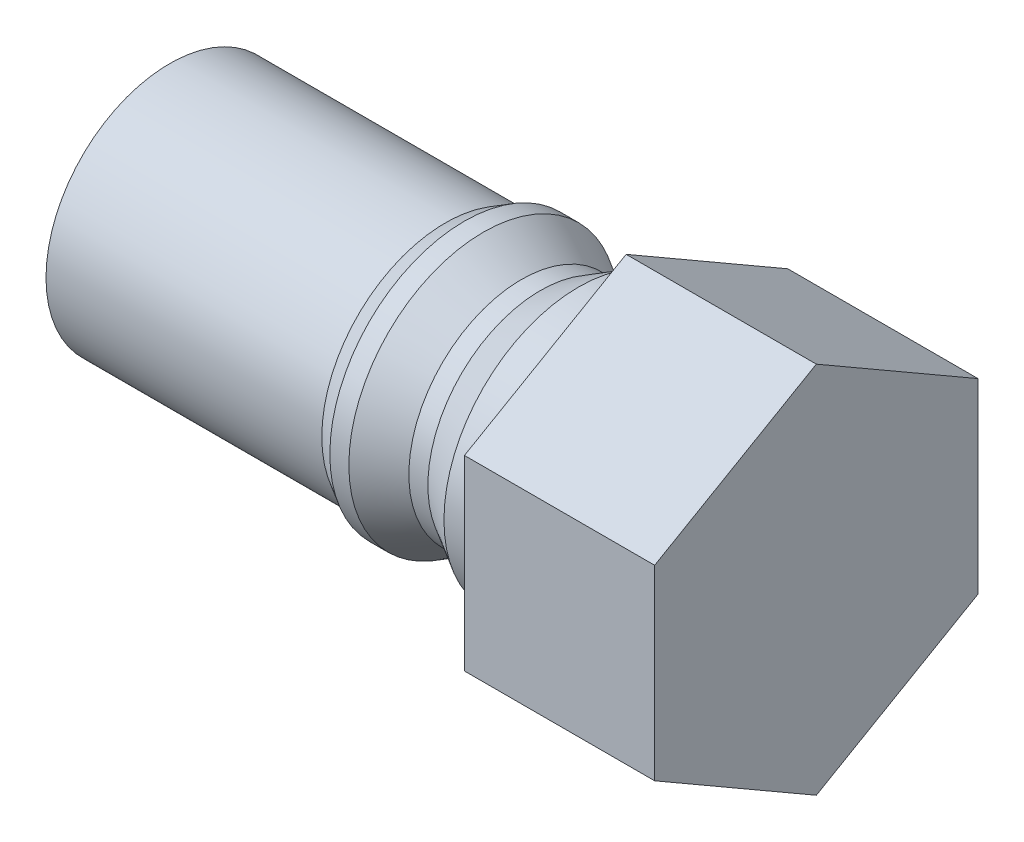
ISO-10303-21;
HEADER;
FILE_DESCRIPTION(('STEP AP214'),'2;1');
FILE_NAME('part.step','',(''),(''),'','','');
FILE_SCHEMA(('AUTOMOTIVE_DESIGN { 1 0 10303 214 1 1 1 1 }'));
ENDSEC;
DATA;
#1=APPLICATION_CONTEXT('core data for automotive mechanical design processes');
#2=APPLICATION_PROTOCOL_DEFINITION('international standard','automotive_design',2000,#1);
#3=PRODUCT_CONTEXT('',#1,'mechanical');
#4=PRODUCT('Part','Part','',(#3));
#5=PRODUCT_RELATED_PRODUCT_CATEGORY('part','',(#4));
#6=PRODUCT_DEFINITION_FORMATION('','',#4);
#7=PRODUCT_DEFINITION_CONTEXT('part definition',#1,'design');
#8=PRODUCT_DEFINITION('design','',#6,#7);
#9=PRODUCT_DEFINITION_SHAPE('','',#8);
#10=(LENGTH_UNIT() NAMED_UNIT(*) SI_UNIT(.MILLI.,.METRE.));
#11=(NAMED_UNIT(*) PLANE_ANGLE_UNIT() SI_UNIT($,.RADIAN.));
#12=(NAMED_UNIT(*) SI_UNIT($,.STERADIAN.) SOLID_ANGLE_UNIT());
#13=UNCERTAINTY_MEASURE_WITH_UNIT(LENGTH_MEASURE(1.E-05),#10,'distance_accuracy_value','');
#14=(GEOMETRIC_REPRESENTATION_CONTEXT(3) GLOBAL_UNCERTAINTY_ASSIGNED_CONTEXT((#13)) GLOBAL_UNIT_ASSIGNED_CONTEXT((#10,
#11,#12)) REPRESENTATION_CONTEXT('',''));
#15=CARTESIAN_POINT('',(0.,0.,0.));
#16=DIRECTION('',(0.,0.,1.));
#17=DIRECTION('',(1.,0.,0.));
#18=AXIS2_PLACEMENT_3D('',#15,#16,#17);
#19=CARTESIAN_POINT('',(0.,0.,0.));
#20=DIRECTION('',(-1.,0.,0.));
#21=DIRECTION('',(0.,0.,1.));
#22=AXIS2_PLACEMENT_3D('',#19,#20,#21);
#23=PLANE('',#22);
#24=CARTESIAN_POINT('',(0.,0.,0.));
#25=DIRECTION('',(1.,0.,0.));
#26=DIRECTION('',(0.,0.,-1.));
#27=AXIS2_PLACEMENT_3D('',#24,#25,#26);
#28=CIRCLE('',#27,6.5);
#29=CARTESIAN_POINT('',(0.,0.,-6.5));
#30=VERTEX_POINT('',#29);
#31=EDGE_CURVE('E11',#30,#30,#28,.T.);
#32=ORIENTED_EDGE('',*,*,#31,.F.);
#33=EDGE_LOOP('',(#32));
#34=FACE_BOUND('',#33,.T.);
#35=ADVANCED_FACE('F33',(#34),#23,.T.);
#36=CARTESIAN_POINT('',(24.,0.,0.));
#37=DIRECTION('',(1.,0.,0.));
#38=DIRECTION('',(0.,0.,-1.));
#39=AXIS2_PLACEMENT_3D('',#36,#37,#38);
#40=CYLINDRICAL_SURFACE('',#39,6.5);
#41=ORIENTED_EDGE('',*,*,#31,.T.);
#42=EDGE_LOOP('',(#41));
#43=FACE_BOUND('',#42,.T.);
#44=CARTESIAN_POINT('',(14.5,0.,0.));
#45=DIRECTION('',(1.,0.,0.));
#46=DIRECTION('',(0.,0.,-1.));
#47=AXIS2_PLACEMENT_3D('',#44,#45,#46);
#48=CIRCLE('',#47,6.5);
#49=CARTESIAN_POINT('',(14.5,0.,-6.5));
#50=VERTEX_POINT('',#49);
#51=EDGE_CURVE('E41',#50,#50,#48,.T.);
#52=ORIENTED_EDGE('',*,*,#51,.F.);
#53=EDGE_LOOP('',(#52));
#54=FACE_BOUND('',#53,.T.);
#55=ADVANCED_FACE('F160',(#43,#54),#40,.T.);
#56=CARTESIAN_POINT('',(15.5,0.,0.));
#57=DIRECTION('',(1.,0.,0.));
#58=DIRECTION('',(0.,0.,-1.));
#59=AXIS2_PLACEMENT_3D('',#56,#57,#58);
#60=CONICAL_SURFACE('',#59,7.07735026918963,0.523598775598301);
#61=ORIENTED_EDGE('',*,*,#51,.T.);
#62=EDGE_LOOP('',(#61));
#63=FACE_BOUND('',#62,.T.);
#64=CARTESIAN_POINT('',(15.5,0.,0.));
#65=DIRECTION('',(1.,0.,0.));
#66=DIRECTION('',(0.,0.,-1.));
#67=AXIS2_PLACEMENT_3D('',#64,#65,#66);
#68=CIRCLE('',#67,7.07735026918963);
#69=CARTESIAN_POINT('',(15.5,0.,-7.07735026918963));
#70=VERTEX_POINT('',#69);
#71=EDGE_CURVE('E152',#70,#70,#68,.T.);
#72=ORIENTED_EDGE('',*,*,#71,.F.);
#73=EDGE_LOOP('',(#72));
#74=FACE_BOUND('',#73,.T.);
#75=ADVANCED_FACE('F157',(#63,#74),#60,.T.);
#76=CARTESIAN_POINT('',(24.,0.,0.));
#77=DIRECTION('',(1.,0.,0.));
#78=DIRECTION('',(0.,0.,-1.));
#79=AXIS2_PLACEMENT_3D('',#76,#77,#78);
#80=CYLINDRICAL_SURFACE('',#79,7.07735026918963);
#81=ORIENTED_EDGE('',*,*,#71,.T.);
#82=EDGE_LOOP('',(#81));
#83=FACE_BOUND('',#82,.T.);
#84=CARTESIAN_POINT('',(16.5,0.,0.));
#85=DIRECTION('',(1.,0.,0.));
#86=DIRECTION('',(0.,0.,-1.));
#87=AXIS2_PLACEMENT_3D('',#84,#85,#86);
#88=CIRCLE('',#87,7.07735026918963);
#89=CARTESIAN_POINT('',(16.5,0.,-7.07735026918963));
#90=VERTEX_POINT('',#89);
#91=EDGE_CURVE('E149',#90,#90,#88,.T.);
#92=ORIENTED_EDGE('',*,*,#91,.F.);
#93=EDGE_LOOP('',(#92));
#94=FACE_BOUND('',#93,.T.);
#95=ADVANCED_FACE('F167',(#83,#94),#80,.T.);
#96=CARTESIAN_POINT('',(18.5,0.,0.));
#97=DIRECTION('',(-1.,0.,0.));
#98=DIRECTION('',(0.,0.,1.));
#99=AXIS2_PLACEMENT_3D('',#96,#97,#98);
#100=CONICAL_SURFACE('',#99,5.92264973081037,0.523598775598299);
#101=ORIENTED_EDGE('',*,*,#91,.T.);
#102=EDGE_LOOP('',(#101));
#103=FACE_BOUND('',#102,.T.);
#104=CARTESIAN_POINT('',(18.5,0.,0.));
#105=DIRECTION('',(1.,0.,0.));
#106=DIRECTION('',(0.,0.,-1.));
#107=AXIS2_PLACEMENT_3D('',#104,#105,#106);
#108=CIRCLE('',#107,5.92264973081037);
#109=CARTESIAN_POINT('',(18.5,0.,-5.92264973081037));
#110=VERTEX_POINT('',#109);
#111=EDGE_CURVE('E146',#110,#110,#108,.T.);
#112=ORIENTED_EDGE('',*,*,#111,.F.);
#113=EDGE_LOOP('',(#112));
#114=FACE_BOUND('',#113,.T.);
#115=ADVANCED_FACE('F173',(#103,#114),#100,.T.);
#116=CARTESIAN_POINT('',(24.,0.,0.));
#117=DIRECTION('',(1.,0.,0.));
#118=DIRECTION('',(0.,0.,-1.));
#119=AXIS2_PLACEMENT_3D('',#116,#117,#118);
#120=CYLINDRICAL_SURFACE('',#119,5.92264973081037);
#121=ORIENTED_EDGE('',*,*,#111,.T.);
#122=EDGE_LOOP('',(#121));
#123=FACE_BOUND('',#122,.T.);
#124=CARTESIAN_POINT('',(19.5,0.,0.));
#125=DIRECTION('',(1.,0.,0.));
#126=DIRECTION('',(0.,0.,-1.));
#127=AXIS2_PLACEMENT_3D('',#124,#125,#126);
#128=CIRCLE('',#127,5.92264973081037);
#129=CARTESIAN_POINT('',(19.5,0.,-5.92264973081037));
#130=VERTEX_POINT('',#129);
#131=EDGE_CURVE('E143',#130,#130,#128,.T.);
#132=ORIENTED_EDGE('',*,*,#131,.F.);
#133=EDGE_LOOP('',(#132));
#134=FACE_BOUND('',#133,.T.);
#135=ADVANCED_FACE('F177',(#123,#134),#120,.T.);
#136=CARTESIAN_POINT('',(21.5,0.,0.));
#137=DIRECTION('',(1.,0.,0.));
#138=DIRECTION('',(0.,0.,-1.));
#139=AXIS2_PLACEMENT_3D('',#136,#137,#138);
#140=CONICAL_SURFACE('',#139,7.07735026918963,0.523598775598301);
#141=ORIENTED_EDGE('',*,*,#131,.T.);
#142=EDGE_LOOP('',(#141));
#143=FACE_BOUND('',#142,.T.);
#144=CARTESIAN_POINT('',(21.5,0.,0.));
#145=DIRECTION('',(1.,0.,0.));
#146=DIRECTION('',(0.,0.,-1.));
#147=AXIS2_PLACEMENT_3D('',#144,#145,#146);
#148=CIRCLE('',#147,7.07735026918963);
#149=CARTESIAN_POINT('',(21.5,0.,-7.07735026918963));
#150=VERTEX_POINT('',#149);
#151=EDGE_CURVE('E140',#150,#150,#148,.T.);
#152=ORIENTED_EDGE('',*,*,#151,.F.);
#153=EDGE_LOOP('',(#152));
#154=FACE_BOUND('',#153,.T.);
#155=ADVANCED_FACE('F181',(#143,#154),#140,.T.);
#156=CARTESIAN_POINT('',(24.,0.,0.));
#157=DIRECTION('',(1.,0.,0.));
#158=DIRECTION('',(0.,0.,-1.));
#159=AXIS2_PLACEMENT_3D('',#156,#157,#158);
#160=CYLINDRICAL_SURFACE('',#159,7.07735026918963);
#161=ORIENTED_EDGE('',*,*,#151,.T.);
#162=EDGE_LOOP('',(#161));
#163=FACE_BOUND('',#162,.T.);
#164=CARTESIAN_POINT('',(24.,0.,0.));
#165=DIRECTION('',(1.,0.,0.));
#166=DIRECTION('',(0.,0.,-1.));
#167=AXIS2_PLACEMENT_3D('',#164,#165,#166);
#168=CIRCLE('',#167,7.07735026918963);
#169=CARTESIAN_POINT('',(24.,0.,-7.07735026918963));
#170=VERTEX_POINT('',#169);
#171=EDGE_CURVE('E137',#170,#170,#168,.T.);
#172=ORIENTED_EDGE('',*,*,#171,.F.);
#173=EDGE_LOOP('',(#172));
#174=FACE_BOUND('',#173,.T.);
#175=ADVANCED_FACE('F185',(#163,#174),#160,.T.);
#176=CARTESIAN_POINT('',(34.,4.90747728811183,-8.5));
#177=DIRECTION('',(0.,-0.866025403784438,0.5));
#178=DIRECTION('',(0.,-0.5,-0.866025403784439));
#179=AXIS2_PLACEMENT_3D('',#176,#177,#178);
#180=PLANE('',#179);
#181=DIRECTION('',(0.,0.5,0.866025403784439));
#182=VECTOR('',#181,1.);
#183=CARTESIAN_POINT('',(24.,4.90747728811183,-8.5));
#184=LINE('',#183,#182);
#185=CARTESIAN_POINT('',(24.,4.90747728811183,-8.5));
#186=VERTEX_POINT('',#185);
#187=CARTESIAN_POINT('',(24.,9.81495457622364,0.));
#188=VERTEX_POINT('',#187);
#189=EDGE_CURVE('E118',#186,#188,#184,.T.);
#190=ORIENTED_EDGE('',*,*,#189,.T.);
#191=DIRECTION('',(-1.,0.,0.));
#192=VECTOR('',#191,1.);
#193=CARTESIAN_POINT('',(34.,9.81495457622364,0.));
#194=LINE('',#193,#192);
#195=CARTESIAN_POINT('',(34.,9.81495457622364,0.));
#196=VERTEX_POINT('',#195);
#197=EDGE_CURVE('E135',#196,#188,#194,.T.);
#198=ORIENTED_EDGE('',*,*,#197,.F.);
#199=DIRECTION('',(0.,0.5,0.866025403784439));
#200=VECTOR('',#199,1.);
#201=CARTESIAN_POINT('',(34.,4.90747728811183,-8.5));
#202=LINE('',#201,#200);
#203=CARTESIAN_POINT('',(34.,4.90747728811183,-8.5));
#204=VERTEX_POINT('',#203);
#205=EDGE_CURVE('E128',#204,#196,#202,.T.);
#206=ORIENTED_EDGE('',*,*,#205,.F.);
#207=DIRECTION('',(-1.,0.,0.));
#208=VECTOR('',#207,1.);
#209=CARTESIAN_POINT('',(34.,4.90747728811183,-8.5));
#210=LINE('',#209,#208);
#211=EDGE_CURVE('E114',#204,#186,#210,.T.);
#212=ORIENTED_EDGE('',*,*,#211,.T.);
#213=EDGE_LOOP('',(#190,#198,#206,#212));
#214=FACE_BOUND('',#213,.T.);
#215=ADVANCED_FACE('F189',(#214),#180,.F.);
#216=CARTESIAN_POINT('',(34.,9.81495457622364,0.));
#217=DIRECTION('',(0.,-0.866025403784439,-0.5));
#218=DIRECTION('',(0.,0.5,-0.866025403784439));
#219=AXIS2_PLACEMENT_3D('',#216,#217,#218);
#220=PLANE('',#219);
#221=DIRECTION('',(0.,-0.5,0.866025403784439));
#222=VECTOR('',#221,1.);
#223=CARTESIAN_POINT('',(24.,9.81495457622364,0.));
#224=LINE('',#223,#222);
#225=CARTESIAN_POINT('',(24.,4.90747728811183,8.5));
#226=VERTEX_POINT('',#225);
#227=EDGE_CURVE('E121',#188,#226,#224,.T.);
#228=ORIENTED_EDGE('',*,*,#227,.T.);
#229=DIRECTION('',(-1.,0.,0.));
#230=VECTOR('',#229,1.);
#231=CARTESIAN_POINT('',(34.,4.90747728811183,8.5));
#232=LINE('',#231,#230);
#233=CARTESIAN_POINT('',(34.,4.90747728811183,8.5));
#234=VERTEX_POINT('',#233);
#235=EDGE_CURVE('E132',#234,#226,#232,.T.);
#236=ORIENTED_EDGE('',*,*,#235,.F.);
#237=DIRECTION('',(0.,-0.5,0.866025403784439));
#238=VECTOR('',#237,1.);
#239=CARTESIAN_POINT('',(34.,9.81495457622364,0.));
#240=LINE('',#239,#238);
#241=EDGE_CURVE('E87',#196,#234,#240,.T.);
#242=ORIENTED_EDGE('',*,*,#241,.F.);
#243=ORIENTED_EDGE('',*,*,#197,.T.);
#244=EDGE_LOOP('',(#228,#236,#242,#243));
#245=FACE_BOUND('',#244,.T.);
#246=ADVANCED_FACE('F193',(#245),#220,.F.);
#247=CARTESIAN_POINT('',(34.,4.90747728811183,8.5));
#248=DIRECTION('',(0.,0.,-1.));
#249=DIRECTION('',(-1.,0.,0.));
#250=AXIS2_PLACEMENT_3D('',#247,#248,#249);
#251=PLANE('',#250);
#252=DIRECTION('',(0.,-1.,0.));
#253=VECTOR('',#252,1.);
#254=CARTESIAN_POINT('',(24.,4.90747728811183,8.5));
#255=LINE('',#254,#253);
#256=CARTESIAN_POINT('',(24.,-4.90747728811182,8.5));
#257=VERTEX_POINT('',#256);
#258=EDGE_CURVE('E123',#226,#257,#255,.T.);
#259=ORIENTED_EDGE('',*,*,#258,.T.);
#260=DIRECTION('',(-1.,0.,0.));
#261=VECTOR('',#260,1.);
#262=CARTESIAN_POINT('',(34.,-4.90747728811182,8.5));
#263=LINE('',#262,#261);
#264=CARTESIAN_POINT('',(34.,-4.90747728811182,8.5));
#265=VERTEX_POINT('',#264);
#266=EDGE_CURVE('E109',#265,#257,#263,.T.);
#267=ORIENTED_EDGE('',*,*,#266,.F.);
#268=DIRECTION('',(0.,-1.,0.));
#269=VECTOR('',#268,1.);
#270=CARTESIAN_POINT('',(34.,4.90747728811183,8.5));
#271=LINE('',#270,#269);
#272=EDGE_CURVE('E100',#234,#265,#271,.T.);
#273=ORIENTED_EDGE('',*,*,#272,.F.);
#274=ORIENTED_EDGE('',*,*,#235,.T.);
#275=EDGE_LOOP('',(#259,#267,#273,#274));
#276=FACE_BOUND('',#275,.T.);
#277=ADVANCED_FACE('F197',(#276),#251,.F.);
#278=CARTESIAN_POINT('',(34.,-4.90747728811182,8.5));
#279=DIRECTION('',(0.,0.866025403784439,-0.5));
#280=DIRECTION('',(0.,0.5,0.866025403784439));
#281=AXIS2_PLACEMENT_3D('',#278,#279,#280);
#282=PLANE('',#281);
#283=DIRECTION('',(0.,-0.5,-0.866025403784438));
#284=VECTOR('',#283,1.);
#285=CARTESIAN_POINT('',(24.,-4.90747728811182,8.5));
#286=LINE('',#285,#284);
#287=CARTESIAN_POINT('',(24.,-9.81495457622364,0.));
#288=VERTEX_POINT('',#287);
#289=EDGE_CURVE('E108',#257,#288,#286,.T.);
#290=ORIENTED_EDGE('',*,*,#289,.T.);
#291=DIRECTION('',(-1.,0.,0.));
#292=VECTOR('',#291,1.);
#293=CARTESIAN_POINT('',(34.,-9.81495457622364,0.));
#294=LINE('',#293,#292);
#295=CARTESIAN_POINT('',(34.,-9.81495457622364,0.));
#296=VERTEX_POINT('',#295);
#297=EDGE_CURVE('E105',#296,#288,#294,.T.);
#298=ORIENTED_EDGE('',*,*,#297,.F.);
#299=DIRECTION('',(0.,-0.5,-0.866025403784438));
#300=VECTOR('',#299,1.);
#301=CARTESIAN_POINT('',(34.,-4.90747728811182,8.5));
#302=LINE('',#301,#300);
#303=EDGE_CURVE('E94',#265,#296,#302,.T.);
#304=ORIENTED_EDGE('',*,*,#303,.F.);
#305=ORIENTED_EDGE('',*,*,#266,.T.);
#306=EDGE_LOOP('',(#290,#298,#304,#305));
#307=FACE_BOUND('',#306,.T.);
#308=ADVANCED_FACE('F106',(#307),#282,.F.);
#309=CARTESIAN_POINT('',(34.,-9.81495457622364,0.));
#310=DIRECTION('',(0.,0.866025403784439,0.5));
#311=DIRECTION('',(0.,-0.5,0.866025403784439));
#312=AXIS2_PLACEMENT_3D('',#309,#310,#311);
#313=PLANE('',#312);
#314=DIRECTION('',(0.,0.5,-0.866025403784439));
#315=VECTOR('',#314,1.);
#316=CARTESIAN_POINT('',(24.,-9.81495457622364,0.));
#317=LINE('',#316,#315);
#318=CARTESIAN_POINT('',(24.,-4.90747728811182,-8.5));
#319=VERTEX_POINT('',#318);
#320=EDGE_CURVE('E72',#288,#319,#317,.T.);
#321=ORIENTED_EDGE('',*,*,#320,.T.);
#322=DIRECTION('',(-1.,0.,0.));
#323=VECTOR('',#322,1.);
#324=CARTESIAN_POINT('',(34.,-4.90747728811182,-8.5));
#325=LINE('',#324,#323);
#326=CARTESIAN_POINT('',(34.,-4.90747728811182,-8.5));
#327=VERTEX_POINT('',#326);
#328=EDGE_CURVE('E110',#327,#319,#325,.T.);
#329=ORIENTED_EDGE('',*,*,#328,.F.);
#330=DIRECTION('',(0.,0.5,-0.866025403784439));
#331=VECTOR('',#330,1.);
#332=CARTESIAN_POINT('',(34.,-9.81495457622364,0.));
#333=LINE('',#332,#331);
#334=EDGE_CURVE('E98',#296,#327,#333,.T.);
#335=ORIENTED_EDGE('',*,*,#334,.F.);
#336=ORIENTED_EDGE('',*,*,#297,.T.);
#337=EDGE_LOOP('',(#321,#329,#335,#336));
#338=FACE_BOUND('',#337,.T.);
#339=ADVANCED_FACE('F112',(#338),#313,.F.);
#340=CARTESIAN_POINT('',(34.,-4.90747728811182,-8.5));
#341=DIRECTION('',(0.,0.,1.));
#342=DIRECTION('',(0.,-1.,0.));
#343=AXIS2_PLACEMENT_3D('',#340,#341,#342);
#344=PLANE('',#343);
#345=DIRECTION('',(0.,1.,0.));
#346=VECTOR('',#345,1.);
#347=CARTESIAN_POINT('',(24.,-4.90747728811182,-8.5));
#348=LINE('',#347,#346);
#349=EDGE_CURVE('E78',#319,#186,#348,.T.);
#350=ORIENTED_EDGE('',*,*,#349,.T.);
#351=ORIENTED_EDGE('',*,*,#211,.F.);
#352=DIRECTION('',(0.,1.,0.));
#353=VECTOR('',#352,1.);
#354=CARTESIAN_POINT('',(34.,-4.90747728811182,-8.5));
#355=LINE('',#354,#353);
#356=EDGE_CURVE('E49',#327,#204,#355,.T.);
#357=ORIENTED_EDGE('',*,*,#356,.F.);
#358=ORIENTED_EDGE('',*,*,#328,.T.);
#359=EDGE_LOOP('',(#350,#351,#357,#358));
#360=FACE_BOUND('',#359,.T.);
#361=ADVANCED_FACE('F205',(#360),#344,.F.);
#362=CARTESIAN_POINT('',(34.,0.,0.));
#363=DIRECTION('',(1.,0.,0.));
#364=DIRECTION('',(0.,0.,-1.));
#365=AXIS2_PLACEMENT_3D('',#362,#363,#364);
#366=PLANE('',#365);
#367=ORIENTED_EDGE('',*,*,#205,.T.);
#368=ORIENTED_EDGE('',*,*,#241,.T.);
#369=ORIENTED_EDGE('',*,*,#272,.T.);
#370=ORIENTED_EDGE('',*,*,#303,.T.);
#371=ORIENTED_EDGE('',*,*,#334,.T.);
#372=ORIENTED_EDGE('',*,*,#356,.T.);
#373=EDGE_LOOP('',(#367,#368,#369,#370,#371,#372));
#374=FACE_BOUND('',#373,.T.);
#375=ADVANCED_FACE('F96',(#374),#366,.T.);
#376=CARTESIAN_POINT('',(24.,0.,0.));
#377=DIRECTION('',(1.,0.,0.));
#378=DIRECTION('',(0.,0.,-1.));
#379=AXIS2_PLACEMENT_3D('',#376,#377,#378);
#380=PLANE('',#379);
#381=ORIENTED_EDGE('',*,*,#171,.T.);
#382=EDGE_LOOP('',(#381));
#383=FACE_BOUND('',#382,.T.);
#384=ORIENTED_EDGE('',*,*,#189,.F.);
#385=ORIENTED_EDGE('',*,*,#349,.F.);
#386=ORIENTED_EDGE('',*,*,#320,.F.);
#387=ORIENTED_EDGE('',*,*,#289,.F.);
#388=ORIENTED_EDGE('',*,*,#258,.F.);
#389=ORIENTED_EDGE('',*,*,#227,.F.);
#390=EDGE_LOOP('',(#384,#385,#386,#387,#388,#389));
#391=FACE_BOUND('',#390,.T.);
#392=ADVANCED_FACE('F208',(#383,#391),#380,.F.);
#393=CLOSED_SHELL('',(#35,#55,#75,#95,#115,#135,#155,#175,#215,#246,#277,#308,#339,#361,#375,#392));
#394=MANIFOLD_SOLID_BREP('B2',#393);
#395=ADVANCED_BREP_SHAPE_REPRESENTATION('',(#18,#394),#14);
#396=SHAPE_DEFINITION_REPRESENTATION(#9,#395);
ENDSEC;
END-ISO-10303-21;
